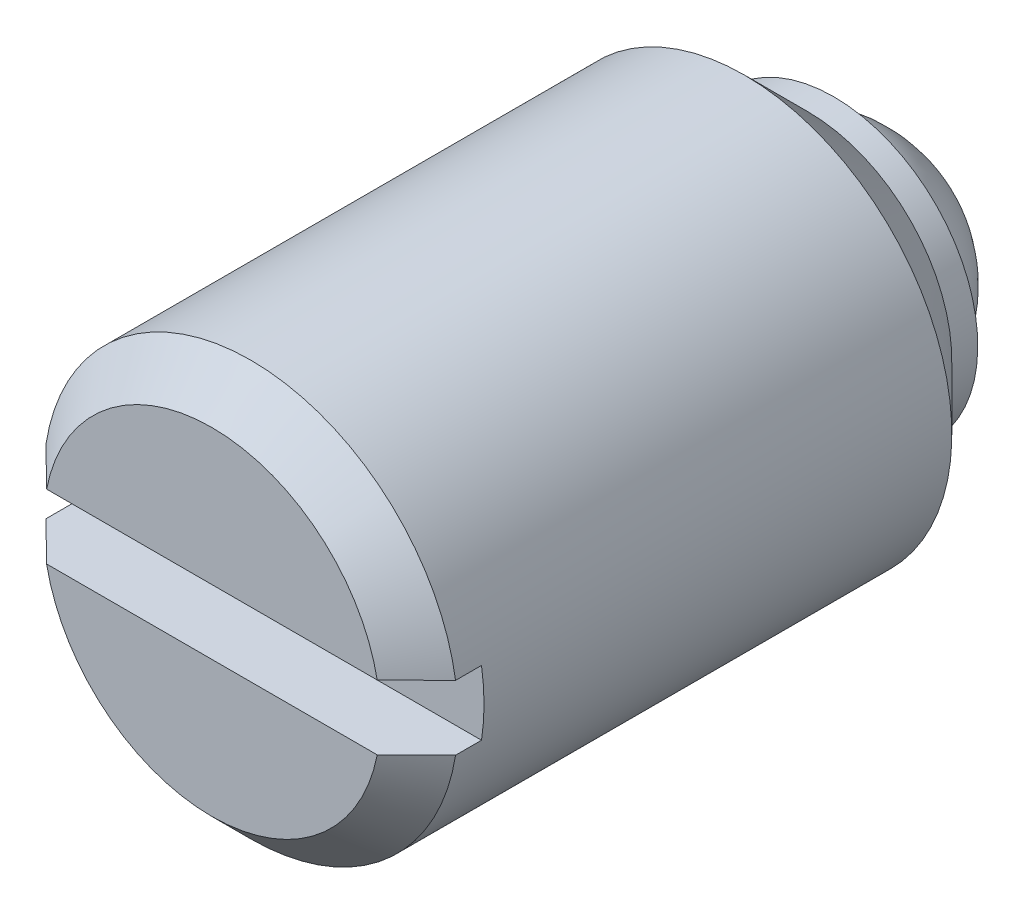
ISO-10303-21;
HEADER;
FILE_DESCRIPTION(('STEP AP214'),'2;1');
FILE_NAME('part.step','',(''),(''),'','','');
FILE_SCHEMA(('AUTOMOTIVE_DESIGN { 1 0 10303 214 1 1 1 1 }'));
ENDSEC;
DATA;
#1=APPLICATION_CONTEXT('core data for automotive mechanical design processes');
#2=APPLICATION_PROTOCOL_DEFINITION('international standard','automotive_design',2000,#1);
#3=PRODUCT_CONTEXT('',#1,'mechanical');
#4=PRODUCT('Part','Part','',(#3));
#5=PRODUCT_RELATED_PRODUCT_CATEGORY('part','',(#4));
#6=PRODUCT_DEFINITION_FORMATION('','',#4);
#7=PRODUCT_DEFINITION_CONTEXT('part definition',#1,'design');
#8=PRODUCT_DEFINITION('design','',#6,#7);
#9=PRODUCT_DEFINITION_SHAPE('','',#8);
#10=(LENGTH_UNIT() NAMED_UNIT(*) SI_UNIT(.MILLI.,.METRE.));
#11=(NAMED_UNIT(*) PLANE_ANGLE_UNIT() SI_UNIT($,.RADIAN.));
#12=(NAMED_UNIT(*) SI_UNIT($,.STERADIAN.) SOLID_ANGLE_UNIT());
#13=UNCERTAINTY_MEASURE_WITH_UNIT(LENGTH_MEASURE(1.E-05),#10,'distance_accuracy_value','');
#14=(GEOMETRIC_REPRESENTATION_CONTEXT(3) GLOBAL_UNCERTAINTY_ASSIGNED_CONTEXT((#13)) GLOBAL_UNIT_ASSIGNED_CONTEXT((#10,
#11,#12)) REPRESENTATION_CONTEXT('',''));
#15=CARTESIAN_POINT('',(0.,0.,0.));
#16=DIRECTION('',(0.,0.,1.));
#17=DIRECTION('',(1.,0.,0.));
#18=AXIS2_PLACEMENT_3D('',#15,#16,#17);
#19=CARTESIAN_POINT('',(0.,8.,27.5));
#20=DIRECTION('',(0.,0.,1.));
#21=DIRECTION('',(1.,0.,0.));
#22=AXIS2_PLACEMENT_3D('',#19,#20,#21);
#23=PLANE('',#22);
#24=CARTESIAN_POINT('',(0.,0.,27.5));
#25=DIRECTION('',(0.,0.,-1.));
#26=DIRECTION('',(0.,1.,0.));
#27=AXIS2_PLACEMENT_3D('',#24,#25,#26);
#28=CIRCLE('',#27,6.5);
#29=CARTESIAN_POINT('',(-6.37867541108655,1.25,27.5));
#30=VERTEX_POINT('',#29);
#31=CARTESIAN_POINT('',(6.37867541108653,1.25,27.5));
#32=VERTEX_POINT('',#31);
#33=EDGE_CURVE('E35',#30,#32,#28,.T.);
#34=ORIENTED_EDGE('',*,*,#33,.F.);
#35=DIRECTION('',(1.,0.,0.));
#36=VECTOR('',#35,1.);
#37=CARTESIAN_POINT('',(-7.90174031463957,1.25,27.5));
#38=LINE('',#37,#36);
#39=EDGE_CURVE('E124',#30,#32,#38,.T.);
#40=ORIENTED_EDGE('',*,*,#39,.T.);
#41=EDGE_LOOP('',(#34,#40));
#42=FACE_BOUND('',#41,.T.);
#43=ADVANCED_FACE('F14',(#42),#23,.T.);
#44=CARTESIAN_POINT('',(0.,0.,-2.5));
#45=DIRECTION('',(0.,0.,-1.));
#46=DIRECTION('',(-1.,0.,0.));
#47=AXIS2_PLACEMENT_3D('',#44,#45,#46);
#48=CYLINDRICAL_SURFACE('',#47,8.);
#49=CARTESIAN_POINT('',(0.,0.,26.));
#50=DIRECTION('',(0.,0.,-1.));
#51=DIRECTION('',(0.,1.,0.));
#52=AXIS2_PLACEMENT_3D('',#49,#50,#51);
#53=CIRCLE('',#52,8.);
#54=CARTESIAN_POINT('',(7.90174031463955,-1.25,26.));
#55=VERTEX_POINT('',#54);
#56=CARTESIAN_POINT('',(-7.90174031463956,-1.25,26.));
#57=VERTEX_POINT('',#56);
#58=EDGE_CURVE('E43',#55,#57,#53,.T.);
#59=ORIENTED_EDGE('',*,*,#58,.T.);
#60=DIRECTION('',(0.,0.,1.));
#61=VECTOR('',#60,1.);
#62=CARTESIAN_POINT('',(-7.90174031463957,-1.25,25.));
#63=LINE('',#62,#61);
#64=CARTESIAN_POINT('',(-7.90174031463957,-1.25,25.));
#65=VERTEX_POINT('',#64);
#66=EDGE_CURVE('E101',#65,#57,#63,.T.);
#67=ORIENTED_EDGE('',*,*,#66,.F.);
#68=CARTESIAN_POINT('',(0.,0.,25.));
#69=DIRECTION('',(0.,0.,1.));
#70=DIRECTION('',(1.,0.,0.));
#71=AXIS2_PLACEMENT_3D('',#68,#69,#70);
#72=CIRCLE('',#71,8.);
#73=CARTESIAN_POINT('',(-7.90174031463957,1.25,25.));
#74=VERTEX_POINT('',#73);
#75=EDGE_CURVE('E121',#74,#65,#72,.T.);
#76=ORIENTED_EDGE('',*,*,#75,.F.);
#77=DIRECTION('',(0.,0.,1.));
#78=VECTOR('',#77,1.);
#79=CARTESIAN_POINT('',(-7.90174031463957,1.25,25.));
#80=LINE('',#79,#78);
#81=CARTESIAN_POINT('',(-7.90174031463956,1.25,26.));
#82=VERTEX_POINT('',#81);
#83=EDGE_CURVE('E89',#74,#82,#80,.T.);
#84=ORIENTED_EDGE('',*,*,#83,.T.);
#85=CARTESIAN_POINT('',(7.90174031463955,1.25,26.));
#86=VERTEX_POINT('',#85);
#87=EDGE_CURVE('E73',#82,#86,#53,.T.);
#88=ORIENTED_EDGE('',*,*,#87,.T.);
#89=DIRECTION('',(0.,0.,1.));
#90=VECTOR('',#89,1.);
#91=CARTESIAN_POINT('',(7.90174031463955,1.25,25.));
#92=LINE('',#91,#90);
#93=CARTESIAN_POINT('',(7.90174031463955,1.25,25.));
#94=VERTEX_POINT('',#93);
#95=EDGE_CURVE('E87',#94,#86,#92,.T.);
#96=ORIENTED_EDGE('',*,*,#95,.F.);
#97=CARTESIAN_POINT('',(7.90174031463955,-1.25,25.));
#98=VERTEX_POINT('',#97);
#99=EDGE_CURVE('E117',#98,#94,#72,.T.);
#100=ORIENTED_EDGE('',*,*,#99,.F.);
#101=DIRECTION('',(0.,0.,1.));
#102=VECTOR('',#101,1.);
#103=CARTESIAN_POINT('',(7.90174031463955,-1.25,25.));
#104=LINE('',#103,#102);
#105=EDGE_CURVE('E96',#98,#55,#104,.T.);
#106=ORIENTED_EDGE('',*,*,#105,.T.);
#107=EDGE_LOOP('',(#59,#67,#76,#84,#88,#96,#100,#106));
#108=FACE_BOUND('',#107,.T.);
#109=CARTESIAN_POINT('',(0.,0.,6.95));
#110=DIRECTION('',(0.,0.,-1.));
#111=DIRECTION('',(0.,1.,0.));
#112=AXIS2_PLACEMENT_3D('',#109,#110,#111);
#113=CIRCLE('',#112,8.);
#114=CARTESIAN_POINT('',(0.,8.,6.95));
#115=VERTEX_POINT('',#114);
#116=EDGE_CURVE('E135',#115,#115,#113,.T.);
#117=ORIENTED_EDGE('',*,*,#116,.F.);
#118=EDGE_LOOP('',(#117));
#119=FACE_BOUND('',#118,.T.);
#120=ADVANCED_FACE('F84',(#108,#119),#48,.T.);
#121=CARTESIAN_POINT('',(6.37867541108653,-1.25,27.5));
#122=VERTEX_POINT('',#121);
#123=CARTESIAN_POINT('',(-6.37867541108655,-1.25,27.5));
#124=VERTEX_POINT('',#123);
#125=EDGE_CURVE('E90',#122,#124,#28,.T.);
#126=ORIENTED_EDGE('',*,*,#125,.F.);
#127=DIRECTION('',(1.,0.,0.));
#128=VECTOR('',#127,1.);
#129=CARTESIAN_POINT('',(-7.90174031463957,-1.25,27.5));
#130=LINE('',#129,#128);
#131=EDGE_CURVE('E114',#124,#122,#130,.T.);
#132=ORIENTED_EDGE('',*,*,#131,.F.);
#133=EDGE_LOOP('',(#126,#132));
#134=FACE_BOUND('',#133,.T.);
#135=ADVANCED_FACE('F167',(#134),#23,.T.);
#136=CARTESIAN_POINT('',(-7.90174031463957,1.25,25.));
#137=DIRECTION('',(0.,-1.,0.));
#138=DIRECTION('',(1.,0.,0.));
#139=AXIS2_PLACEMENT_3D('',#136,#137,#138);
#140=PLANE('',#139);
#141=CARTESIAN_POINT('',(-17.4266450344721,1.25,16.5285817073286));
#142=CARTESIAN_POINT('',(-16.8210866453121,1.25,17.1325756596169));
#143=CARTESIAN_POINT('',(-16.2154595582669,1.25,17.7365007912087));
#144=CARTESIAN_POINT('',(-15.003960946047,1.25,18.9441407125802));
#145=CARTESIAN_POINT('',(-14.3980894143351,1.25,19.5478554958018));
#146=CARTESIAN_POINT('',(-13.1856250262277,1.25,20.7553702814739));
#147=CARTESIAN_POINT('',(-12.579031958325,1.25,21.3591700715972));
#148=CARTESIAN_POINT('',(-11.3653769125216,1.25,22.5662641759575));
#149=CARTESIAN_POINT('',(-10.7583149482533,1.25,23.1695585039));
#150=CARTESIAN_POINT('',(-9.54726902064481,1.25,24.3715377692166));
#151=CARTESIAN_POINT('',(-8.94328997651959,1.25,24.9702276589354));
#152=CARTESIAN_POINT('',(-8.03625207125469,1.25,25.8672336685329));
#153=CARTESIAN_POINT('',(-7.73371478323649,1.25,26.166077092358));
#154=CARTESIAN_POINT('',(-7.12814656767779,1.25,26.7632585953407));
#155=CARTESIAN_POINT('',(-6.82511564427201,1.25,27.0615966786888));
#156=CARTESIAN_POINT('',(-6.21845497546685,1.25,27.6574118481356));
#157=CARTESIAN_POINT('',(-5.91482553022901,1.25,27.9548892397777));
#158=CARTESIAN_POINT('',(-5.30644856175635,1.25,28.5487203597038));
#159=CARTESIAN_POINT('',(-5.00170100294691,1.25,28.8450740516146));
#160=CARTESIAN_POINT('',(-4.54320232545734,1.25,29.2881348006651));
#161=CARTESIAN_POINT('',(-4.39015120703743,1.25,29.4355659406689));
#162=CARTESIAN_POINT('',(-4.08341555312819,1.25,29.7297674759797));
#163=CARTESIAN_POINT('',(-3.92973101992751,1.25,29.87653787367));
#164=CARTESIAN_POINT('',(-3.62149706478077,1.25,30.1691522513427));
#165=CARTESIAN_POINT('',(-3.46694768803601,1.25,30.3149962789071));
#166=CARTESIAN_POINT('',(-3.15660483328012,1.25,30.6053534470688));
#167=CARTESIAN_POINT('',(-3.00081138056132,1.25,30.7498666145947));
#168=CARTESIAN_POINT('',(-2.80126227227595,1.25,30.9325450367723));
#169=CARTESIAN_POINT('',(-2.75837814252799,1.25,30.9716624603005));
#170=CARTESIAN_POINT('',(-2.67244812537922,1.25,31.0497194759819));
#171=CARTESIAN_POINT('',(-2.62940223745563,1.25,31.0886590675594));
#172=CARTESIAN_POINT('',(-2.4999878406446,1.25,31.2051788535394));
#173=CARTESIAN_POINT('',(-2.41334630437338,1.25,31.2824566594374));
#174=CARTESIAN_POINT('',(-2.23891853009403,1.25,31.4361071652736));
#175=CARTESIAN_POINT('',(-2.15113016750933,1.25,31.5124774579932));
#176=CARTESIAN_POINT('',(-1.97428550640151,1.25,31.6637217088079));
#177=CARTESIAN_POINT('',(-1.88522935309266,1.25,31.7385958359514));
#178=CARTESIAN_POINT('',(-1.71594078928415,1.25,31.8775257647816));
#179=CARTESIAN_POINT('',(-1.63590307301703,1.25,31.9418178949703));
#180=CARTESIAN_POINT('',(-1.47397804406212,1.25,32.0680241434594));
#181=CARTESIAN_POINT('',(-1.39209099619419,1.25,32.1299385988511));
#182=CARTESIAN_POINT('',(-1.22584168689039,1.25,32.2501758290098));
#183=CARTESIAN_POINT('',(-1.14148238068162,1.25,32.3085026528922));
#184=CARTESIAN_POINT('',(-0.969232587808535,1.25,32.4196297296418));
#185=CARTESIAN_POINT('',(-0.881345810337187,1.25,32.4724355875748));
#186=CARTESIAN_POINT('',(-0.711862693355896,1.25,32.5630701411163));
#187=CARTESIAN_POINT('',(-0.630836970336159,1.25,32.6019439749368));
#188=CARTESIAN_POINT('',(-0.464343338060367,1.25,32.6686935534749));
#189=CARTESIAN_POINT('',(-0.378888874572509,1.25,32.6966006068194));
#190=CARTESIAN_POINT('',(-0.255708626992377,1.25,32.7245951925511));
#191=CARTESIAN_POINT('',(-0.21948944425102,1.25,32.7313894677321));
#192=CARTESIAN_POINT('',(-0.146619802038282,1.25,32.7419455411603));
#193=CARTESIAN_POINT('',(-0.109969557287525,1.25,32.745708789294));
#194=CARTESIAN_POINT('',(-0.0365066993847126,1.25,32.7500038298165));
#195=CARTESIAN_POINT('',(0.000305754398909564,1.25,32.7505382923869));
#196=CARTESIAN_POINT('',(0.0738274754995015,1.25,32.7483628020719));
#197=CARTESIAN_POINT('',(0.11053673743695,1.25,32.7456526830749));
#198=CARTESIAN_POINT('',(0.219755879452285,1.25,32.7328728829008));
#199=CARTESIAN_POINT('',(0.291761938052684,1.25,32.7181751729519));
#200=CARTESIAN_POINT('',(0.397613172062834,1.25,32.6887313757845));
#201=CARTESIAN_POINT('',(0.432580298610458,1.25,32.6776651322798));
#202=CARTESIAN_POINT('',(0.501783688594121,1.25,32.6534332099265));
#203=CARTESIAN_POINT('',(0.536020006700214,1.25,32.6402676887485));
#204=CARTESIAN_POINT('',(0.621590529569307,1.25,32.6047741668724));
#205=CARTESIAN_POINT('',(0.672434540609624,1.25,32.5812720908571));
#206=CARTESIAN_POINT('',(0.772578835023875,1.25,32.5311573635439));
#207=CARTESIAN_POINT('',(0.821878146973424,1.25,32.5045428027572));
#208=CARTESIAN_POINT('',(0.919228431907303,1.25,32.4489096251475));
#209=CARTESIAN_POINT('',(0.967276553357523,1.25,32.4198860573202));
#210=CARTESIAN_POINT('',(1.0622382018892,1.25,32.3600316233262));
#211=CARTESIAN_POINT('',(1.1091514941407,1.25,32.3292003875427));
#212=CARTESIAN_POINT('',(1.2493247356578,1.25,32.2340615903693));
#213=CARTESIAN_POINT('',(1.3411415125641,1.25,32.1676302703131));
#214=CARTESIAN_POINT('',(1.47679782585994,1.25,32.0654276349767));
#215=CARTESIAN_POINT('',(1.52164228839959,1.25,32.0309582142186));
#216=CARTESIAN_POINT('',(1.61076861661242,1.25,31.9612995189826));
#217=CARTESIAN_POINT('',(1.65505050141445,1.25,31.9261102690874));
#218=CARTESIAN_POINT('',(1.80095023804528,1.25,31.8085941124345));
#219=CARTESIAN_POINT('',(1.9015520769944,1.25,31.7250080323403));
#220=CARTESIAN_POINT('',(2.10103789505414,1.25,31.5558049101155));
#221=CARTESIAN_POINT('',(2.19992169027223,1.25,31.4701876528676));
#222=CARTESIAN_POINT('',(2.39647869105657,1.25,31.297518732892));
#223=CARTESIAN_POINT('',(2.49415152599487,1.25,31.2104666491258));
#224=CARTESIAN_POINT('',(2.6885800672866,1.25,31.035342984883));
#225=CARTESIAN_POINT('',(2.7853357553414,1.25,30.9472713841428));
#226=CARTESIAN_POINT('',(3.07482814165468,1.25,30.6817019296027));
#227=CARTESIAN_POINT('',(3.26653180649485,1.25,30.503079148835));
#228=CARTESIAN_POINT('',(3.64823435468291,1.25,30.1440988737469));
#229=CARTESIAN_POINT('',(3.83823354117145,1.25,29.9637417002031));
#230=CARTESIAN_POINT('',(4.21574729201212,1.25,29.6031920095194));
#231=CARTESIAN_POINT('',(4.40326987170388,1.25,29.4230078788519));
#232=CARTESIAN_POINT('',(4.77757245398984,1.25,29.0618533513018));
#233=CARTESIAN_POINT('',(4.96435242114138,1.25,28.880882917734));
#234=CARTESIAN_POINT('',(5.33724380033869,1.25,28.5185093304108));
#235=CARTESIAN_POINT('',(5.52335558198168,1.25,28.3371065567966));
#236=CARTESIAN_POINT('',(5.89517266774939,1.25,27.9738906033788));
#237=CARTESIAN_POINT('',(6.08087797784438,1.25,27.792077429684));
#238=CARTESIAN_POINT('',(6.73183263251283,1.25,27.1537117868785));
#239=CARTESIAN_POINT('',(7.19628647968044,1.25,26.6963483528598));
#240=CARTESIAN_POINT('',(8.12416030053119,1.25,25.7805691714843));
#241=CARTESIAN_POINT('',(8.5875802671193,1.25,25.3221534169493));
#242=CARTESIAN_POINT('',(9.51390860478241,1.25,24.4045354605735));
#243=CARTESIAN_POINT('',(9.97681678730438,1.25,23.945333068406));
#244=CARTESIAN_POINT('',(10.9022083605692,1.25,23.0265026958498));
#245=CARTESIAN_POINT('',(11.3646917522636,1.25,22.566874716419));
#246=CARTESIAN_POINT('',(12.2941479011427,1.25,21.6425663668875));
#247=CARTESIAN_POINT('',(12.7611176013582,1.25,21.1778829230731));
#248=CARTESIAN_POINT('',(13.6948418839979,1.25,20.2482992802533));
#249=CARTESIAN_POINT('',(14.1615964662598,1.25,19.7833990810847));
#250=CARTESIAN_POINT('',(15.0948026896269,1.25,18.853581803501));
#251=CARTESIAN_POINT('',(15.5612543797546,1.25,18.3886647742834));
#252=CARTESIAN_POINT('',(16.4940337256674,1.25,17.4587070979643));
#253=CARTESIAN_POINT('',(16.960361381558,1.25,16.9936664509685));
#254=CARTESIAN_POINT('',(17.4266450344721,1.25,16.5285817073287));
#255=B_SPLINE_CURVE_WITH_KNOTS('',3,(#141,#142,#143,#144,#145,#146,#147,#148,#149,#150,#151,
#152,#153,#154,#155,#156,#157,#158,#159,#160,#161,#162,#163,#164,#165,#166,#167,#168,#169,#170,
#171,#172,#173,#174,#175,#176,#177,#178,#179,#180,#181,#182,#183,#184,#185,#186,#187,#188,#189,
#190,#191,#192,#193,#194,#195,#196,#197,#198,#199,#200,#201,#202,#203,#204,#205,#206,#207,#208,
#209,#210,#211,#212,#213,#214,#215,#216,#217,#218,#219,#220,#221,#222,#223,#224,#225,#226,#227,
#228,#229,#230,#231,#232,#233,#234,#235,#236,#237,#238,#239,#240,#241,#242,#243,#244,#245,#246,
#247,#248,#249,#250,#251,#252,#253,#254),.UNSPECIFIED.,.F.,.F.,(4,2,2,2,2,2,2,2,2,2,2,2,2,2,2,2,
2,2,2,2,2,2,2,2,2,2,2,2,2,2,2,2,2,2,2,2,2,2,2,2,2,2,2,2,2,2,2,2,2,2,2,2,2,2,2,2,4),(0.,
2.56585018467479,5.13177426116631,7.69941188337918,10.2669774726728,12.8182466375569,
14.0939914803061,15.3697256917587,16.644931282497,17.9201778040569,18.5577070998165,
19.1952340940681,19.8327280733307,20.4702091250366,20.6443436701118,20.8184787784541,
21.1667640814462,21.5158273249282,21.8648509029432,22.1728079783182,22.4807212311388,
22.7882803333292,23.0955240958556,23.3646838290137,23.6330694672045,23.7435137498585,
23.853905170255,23.9642052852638,24.0745110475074,24.2939227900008,24.4039083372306,
24.5138856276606,24.681776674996,24.8497712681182,25.0181201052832,25.1865034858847,
25.5263240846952,25.6960060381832,25.8656822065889,26.2580209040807,26.6504013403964,
27.0428990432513,27.4354045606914,28.2214526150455,29.0073579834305,29.7875334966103,
30.5677458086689,31.3474250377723,32.1270927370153,34.0826164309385,36.0381535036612,
37.9942607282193,39.9503635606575,41.9267041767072,43.9030462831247,45.8787803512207,
47.8545127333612),.UNSPECIFIED.);
#256=EDGE_CURVE('E79',#82,#30,#255,.T.);
#257=ORIENTED_EDGE('',*,*,#256,.F.);
#258=ORIENTED_EDGE('',*,*,#83,.F.);
#259=DIRECTION('',(1.,0.,0.));
#260=VECTOR('',#259,1.);
#261=CARTESIAN_POINT('',(-7.90174031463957,1.25,25.));
#262=LINE('',#261,#260);
#263=EDGE_CURVE('E95',#74,#94,#262,.T.);
#264=ORIENTED_EDGE('',*,*,#263,.T.);
#265=ORIENTED_EDGE('',*,*,#95,.T.);
#266=EDGE_CURVE('E70',#32,#86,#255,.T.);
#267=ORIENTED_EDGE('',*,*,#266,.F.);
#268=ORIENTED_EDGE('',*,*,#39,.F.);
#269=EDGE_LOOP('',(#257,#258,#264,#265,#267,#268));
#270=FACE_BOUND('',#269,.T.);
#271=ADVANCED_FACE('F93',(#270),#140,.T.);
#272=CARTESIAN_POINT('',(-7.90174031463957,-1.25,25.));
#273=DIRECTION('',(0.,-1.,0.));
#274=DIRECTION('',(1.,0.,0.));
#275=AXIS2_PLACEMENT_3D('',#272,#273,#274);
#276=PLANE('',#275);
#277=ORIENTED_EDGE('',*,*,#66,.T.);
#278=CARTESIAN_POINT('',(-17.4266450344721,-1.25,16.5285817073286));
#279=CARTESIAN_POINT('',(-16.8210866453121,-1.25,17.1325756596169));
#280=CARTESIAN_POINT('',(-16.2154595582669,-1.25,17.7365007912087));
#281=CARTESIAN_POINT('',(-15.0039609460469,-1.25,18.9441407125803));
#282=CARTESIAN_POINT('',(-14.398089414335,-1.25,19.5478554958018));
#283=CARTESIAN_POINT('',(-13.1856250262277,-1.25,20.755370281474));
#284=CARTESIAN_POINT('',(-12.5790319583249,-1.25,21.3591700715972));
#285=CARTESIAN_POINT('',(-11.3653769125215,-1.25,22.5662641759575));
#286=CARTESIAN_POINT('',(-10.7583149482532,-1.25,23.1695585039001));
#287=CARTESIAN_POINT('',(-9.54726902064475,-1.25,24.3715377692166));
#288=CARTESIAN_POINT('',(-8.94328997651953,-1.25,24.9702276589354));
#289=CARTESIAN_POINT('',(-8.03625207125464,-1.25,25.867233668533));
#290=CARTESIAN_POINT('',(-7.73371478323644,-1.25,26.166077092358));
#291=CARTESIAN_POINT('',(-7.12814656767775,-1.25,26.7632585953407));
#292=CARTESIAN_POINT('',(-6.82511564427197,-1.25,27.0615966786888));
#293=CARTESIAN_POINT('',(-6.21845497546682,-1.25,27.6574118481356));
#294=CARTESIAN_POINT('',(-5.91482553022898,-1.25,27.9548892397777));
#295=CARTESIAN_POINT('',(-5.30644856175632,-1.25,28.5487203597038));
#296=CARTESIAN_POINT('',(-5.00170100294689,-1.25,28.8450740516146));
#297=CARTESIAN_POINT('',(-4.54320232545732,-1.25,29.2881348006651));
#298=CARTESIAN_POINT('',(-4.39015120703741,-1.25,29.435565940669));
#299=CARTESIAN_POINT('',(-4.08341555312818,-1.25,29.7297674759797));
#300=CARTESIAN_POINT('',(-3.9297310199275,-1.25,29.87653787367));
#301=CARTESIAN_POINT('',(-3.62149706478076,-1.25,30.1691522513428));
#302=CARTESIAN_POINT('',(-3.46694768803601,-1.25,30.3149962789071));
#303=CARTESIAN_POINT('',(-3.15660483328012,-1.25,30.6053534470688));
#304=CARTESIAN_POINT('',(-3.00081138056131,-1.25,30.7498666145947));
#305=CARTESIAN_POINT('',(-2.80126227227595,-1.25,30.9325450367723));
#306=CARTESIAN_POINT('',(-2.75837814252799,-1.25,30.9716624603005));
#307=CARTESIAN_POINT('',(-2.67244812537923,-1.25,31.0497194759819));
#308=CARTESIAN_POINT('',(-2.62940223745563,-1.25,31.0886590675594));
#309=CARTESIAN_POINT('',(-2.4999878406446,-1.25,31.2051788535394));
#310=CARTESIAN_POINT('',(-2.41334630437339,-1.25,31.2824566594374));
#311=CARTESIAN_POINT('',(-2.23891853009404,-1.25,31.4361071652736));
#312=CARTESIAN_POINT('',(-2.15113016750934,-1.25,31.5124774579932));
#313=CARTESIAN_POINT('',(-1.97428550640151,-1.25,31.6637217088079));
#314=CARTESIAN_POINT('',(-1.88522935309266,-1.25,31.7385958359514));
#315=CARTESIAN_POINT('',(-1.71594078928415,-1.25,31.8775257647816));
#316=CARTESIAN_POINT('',(-1.63590307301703,-1.25,31.9418178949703));
#317=CARTESIAN_POINT('',(-1.47397804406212,-1.25,32.0680241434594));
#318=CARTESIAN_POINT('',(-1.39209099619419,-1.25,32.1299385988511));
#319=CARTESIAN_POINT('',(-1.22584168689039,-1.25,32.2501758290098));
#320=CARTESIAN_POINT('',(-1.14148238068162,-1.25,32.3085026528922));
#321=CARTESIAN_POINT('',(-0.969232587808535,-1.25,32.4196297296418));
#322=CARTESIAN_POINT('',(-0.881345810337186,-1.25,32.4724355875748));
#323=CARTESIAN_POINT('',(-0.711862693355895,-1.25,32.5630701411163));
#324=CARTESIAN_POINT('',(-0.63083697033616,-1.25,32.6019439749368));
#325=CARTESIAN_POINT('',(-0.464343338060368,-1.25,32.6686935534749));
#326=CARTESIAN_POINT('',(-0.378888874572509,-1.25,32.6966006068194));
#327=CARTESIAN_POINT('',(-0.255708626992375,-1.25,32.7245951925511));
#328=CARTESIAN_POINT('',(-0.219489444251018,-1.25,32.7313894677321));
#329=CARTESIAN_POINT('',(-0.14661980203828,-1.25,32.7419455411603));
#330=CARTESIAN_POINT('',(-0.109969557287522,-1.25,32.745708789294));
#331=CARTESIAN_POINT('',(-0.0365066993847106,-1.25,32.7500038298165));
#332=CARTESIAN_POINT('',(0.000305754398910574,-1.25,32.7505382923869));
#333=CARTESIAN_POINT('',(0.0738274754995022,-1.25,32.7483628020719));
#334=CARTESIAN_POINT('',(0.110536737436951,-1.25,32.7456526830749));
#335=CARTESIAN_POINT('',(0.219755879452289,-1.25,32.7328728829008));
#336=CARTESIAN_POINT('',(0.291761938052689,-1.25,32.7181751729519));
#337=CARTESIAN_POINT('',(0.397613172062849,-1.25,32.6887313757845));
#338=CARTESIAN_POINT('',(0.432580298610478,-1.25,32.6776651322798));
#339=CARTESIAN_POINT('',(0.501783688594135,-1.25,32.6534332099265));
#340=CARTESIAN_POINT('',(0.536020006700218,-1.25,32.6402676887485));
#341=CARTESIAN_POINT('',(0.621590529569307,-1.25,32.6047741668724));
#342=CARTESIAN_POINT('',(0.672434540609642,-1.25,32.581272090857));
#343=CARTESIAN_POINT('',(0.772578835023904,-1.25,32.5311573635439));
#344=CARTESIAN_POINT('',(0.821878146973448,-1.25,32.5045428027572));
#345=CARTESIAN_POINT('',(0.91922843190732,-1.25,32.4489096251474));
#346=CARTESIAN_POINT('',(0.967276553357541,-1.25,32.4198860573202));
#347=CARTESIAN_POINT('',(1.06223820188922,-1.25,32.3600316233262));
#348=CARTESIAN_POINT('',(1.10915149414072,-1.25,32.3292003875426));
#349=CARTESIAN_POINT('',(1.24932473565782,-1.25,32.2340615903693));
#350=CARTESIAN_POINT('',(1.34114151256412,-1.25,32.1676302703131));
#351=CARTESIAN_POINT('',(1.47679782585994,-1.25,32.0654276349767));
#352=CARTESIAN_POINT('',(1.5216422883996,-1.25,32.0309582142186));
#353=CARTESIAN_POINT('',(1.61076861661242,-1.25,31.9612995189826));
#354=CARTESIAN_POINT('',(1.65505050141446,-1.25,31.9261102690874));
#355=CARTESIAN_POINT('',(1.80095023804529,-1.25,31.8085941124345));
#356=CARTESIAN_POINT('',(1.9015520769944,-1.25,31.7250080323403));
#357=CARTESIAN_POINT('',(2.10103789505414,-1.25,31.5558049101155));
#358=CARTESIAN_POINT('',(2.19992169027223,-1.25,31.4701876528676));
#359=CARTESIAN_POINT('',(2.39647869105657,-1.25,31.297518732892));
#360=CARTESIAN_POINT('',(2.49415152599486,-1.25,31.2104666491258));
#361=CARTESIAN_POINT('',(2.6885800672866,-1.25,31.035342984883));
#362=CARTESIAN_POINT('',(2.7853357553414,-1.25,30.9472713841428));
#363=CARTESIAN_POINT('',(3.07482814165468,-1.25,30.6817019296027));
#364=CARTESIAN_POINT('',(3.26653180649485,-1.25,30.503079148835));
#365=CARTESIAN_POINT('',(3.6482343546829,-1.25,30.1440988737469));
#366=CARTESIAN_POINT('',(3.83823354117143,-1.25,29.9637417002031));
#367=CARTESIAN_POINT('',(4.2157472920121,-1.25,29.6031920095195));
#368=CARTESIAN_POINT('',(4.40326987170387,-1.25,29.4230078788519));
#369=CARTESIAN_POINT('',(4.77757245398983,-1.25,29.0618533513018));
#370=CARTESIAN_POINT('',(4.96435242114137,-1.25,28.880882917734));
#371=CARTESIAN_POINT('',(5.33724380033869,-1.25,28.5185093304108));
#372=CARTESIAN_POINT('',(5.52335558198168,-1.25,28.3371065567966));
#373=CARTESIAN_POINT('',(5.8951726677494,-1.25,27.9738906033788));
#374=CARTESIAN_POINT('',(6.0808779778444,-1.25,27.792077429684));
#375=CARTESIAN_POINT('',(6.73183263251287,-1.25,27.1537117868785));
#376=CARTESIAN_POINT('',(7.19628647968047,-1.25,26.6963483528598));
#377=CARTESIAN_POINT('',(8.12416030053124,-1.25,25.7805691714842));
#378=CARTESIAN_POINT('',(8.58758026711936,-1.25,25.3221534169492));
#379=CARTESIAN_POINT('',(9.51390860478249,-1.25,24.4045354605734));
#380=CARTESIAN_POINT('',(9.97681678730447,-1.25,23.945333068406));
#381=CARTESIAN_POINT('',(10.9022083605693,-1.25,23.0265026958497));
#382=CARTESIAN_POINT('',(11.3646917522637,-1.25,22.5668747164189));
#383=CARTESIAN_POINT('',(12.2941479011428,-1.25,21.6425663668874));
#384=CARTESIAN_POINT('',(12.7611176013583,-1.25,21.177882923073));
#385=CARTESIAN_POINT('',(13.694841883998,-1.25,20.2482992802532));
#386=CARTESIAN_POINT('',(14.1615964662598,-1.25,19.7833990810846));
#387=CARTESIAN_POINT('',(15.094802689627,-1.25,18.8535818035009));
#388=CARTESIAN_POINT('',(15.5612543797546,-1.25,18.3886647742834));
#389=CARTESIAN_POINT('',(16.4940337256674,-1.25,17.4587070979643));
#390=CARTESIAN_POINT('',(16.9603613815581,-1.25,16.9936664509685));
#391=CARTESIAN_POINT('',(17.4266450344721,-1.25,16.5285817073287));
#392=B_SPLINE_CURVE_WITH_KNOTS('',3,(#278,#279,#280,#281,#282,#283,#284,#285,#286,#287,#288,
#289,#290,#291,#292,#293,#294,#295,#296,#297,#298,#299,#300,#301,#302,#303,#304,#305,#306,#307,
#308,#309,#310,#311,#312,#313,#314,#315,#316,#317,#318,#319,#320,#321,#322,#323,#324,#325,#326,
#327,#328,#329,#330,#331,#332,#333,#334,#335,#336,#337,#338,#339,#340,#341,#342,#343,#344,#345,
#346,#347,#348,#349,#350,#351,#352,#353,#354,#355,#356,#357,#358,#359,#360,#361,#362,#363,#364,
#365,#366,#367,#368,#369,#370,#371,#372,#373,#374,#375,#376,#377,#378,#379,#380,#381,#382,#383,
#384,#385,#386,#387,#388,#389,#390,#391),.UNSPECIFIED.,.F.,.F.,(4,2,2,2,2,2,2,2,2,2,2,2,2,2,2,2,
2,2,2,2,2,2,2,2,2,2,2,2,2,2,2,2,2,2,2,2,2,2,2,2,2,2,2,2,2,2,2,2,2,2,2,2,2,2,2,2,4),(0.,
2.56585018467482,5.13177426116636,7.69941188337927,10.2669774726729,12.818246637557,
14.0939914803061,15.3697256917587,16.644931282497,17.9201778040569,18.5577070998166,
19.1952340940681,19.8327280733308,20.4702091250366,20.6443436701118,20.8184787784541,
21.1667640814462,21.5158273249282,21.8648509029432,22.1728079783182,22.4807212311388,
22.7882803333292,23.0955240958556,23.3646838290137,23.6330694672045,23.7435137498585,
23.853905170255,23.9642052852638,24.0745110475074,24.2939227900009,24.4039083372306,
24.5138856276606,24.681776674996,24.8497712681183,25.0181201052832,25.1865034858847,
25.5263240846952,25.6960060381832,25.8656822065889,26.2580209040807,26.6504013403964,
27.0428990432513,27.4354045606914,28.2214526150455,29.0073579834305,29.7875334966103,
30.5677458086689,31.3474250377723,32.1270927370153,34.0826164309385,36.0381535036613,
37.9942607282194,39.9503635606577,41.9267041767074,43.9030462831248,45.8787803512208,
47.8545127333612),.UNSPECIFIED.);
#393=EDGE_CURVE('E9',#57,#124,#392,.T.);
#394=ORIENTED_EDGE('',*,*,#393,.T.);
#395=ORIENTED_EDGE('',*,*,#131,.T.);
#396=EDGE_CURVE('E18',#122,#55,#392,.T.);
#397=ORIENTED_EDGE('',*,*,#396,.T.);
#398=ORIENTED_EDGE('',*,*,#105,.F.);
#399=DIRECTION('',(1.,0.,0.));
#400=VECTOR('',#399,1.);
#401=CARTESIAN_POINT('',(-7.90174031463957,-1.25,25.));
#402=LINE('',#401,#400);
#403=EDGE_CURVE('E119',#65,#98,#402,.T.);
#404=ORIENTED_EDGE('',*,*,#403,.F.);
#405=EDGE_LOOP('',(#277,#394,#395,#397,#398,#404));
#406=FACE_BOUND('',#405,.T.);
#407=ADVANCED_FACE('F111',(#406),#276,.F.);
#408=CARTESIAN_POINT('',(0.,0.,25.));
#409=DIRECTION('',(0.,0.,1.));
#410=DIRECTION('',(1.,0.,0.));
#411=AXIS2_PLACEMENT_3D('',#408,#409,#410);
#412=PLANE('',#411);
#413=ORIENTED_EDGE('',*,*,#75,.T.);
#414=ORIENTED_EDGE('',*,*,#403,.T.);
#415=ORIENTED_EDGE('',*,*,#99,.T.);
#416=ORIENTED_EDGE('',*,*,#263,.F.);
#417=EDGE_LOOP('',(#413,#414,#415,#416));
#418=FACE_BOUND('',#417,.T.);
#419=ADVANCED_FACE('F157',(#418),#412,.T.);
#420=CARTESIAN_POINT('',(0.,0.,-3.99429083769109));
#421=DIRECTION('',(0.,0.,-1.));
#422=DIRECTION('',(0.,1.,0.));
#423=AXIS2_PLACEMENT_3D('',#420,#421,#422);
#424=CYLINDRICAL_SURFACE('',#423,5.55);
#425=CARTESIAN_POINT('',(0.,0.,3.5));
#426=DIRECTION('',(0.,0.,-1.));
#427=DIRECTION('',(0.,1.,0.));
#428=AXIS2_PLACEMENT_3D('',#425,#426,#427);
#429=CIRCLE('',#428,5.55);
#430=CARTESIAN_POINT('',(0.,5.55,3.5));
#431=VERTEX_POINT('',#430);
#432=EDGE_CURVE('E127',#431,#431,#429,.T.);
#433=ORIENTED_EDGE('',*,*,#432,.F.);
#434=EDGE_LOOP('',(#433));
#435=FACE_BOUND('',#434,.T.);
#436=CARTESIAN_POINT('',(0.,0.,4.5));
#437=DIRECTION('',(0.,0.,-1.));
#438=DIRECTION('',(0.,1.,0.));
#439=AXIS2_PLACEMENT_3D('',#436,#437,#438);
#440=CIRCLE('',#439,5.55);
#441=CARTESIAN_POINT('',(0.,5.55,4.5));
#442=VERTEX_POINT('',#441);
#443=EDGE_CURVE('E132',#442,#442,#440,.T.);
#444=ORIENTED_EDGE('',*,*,#443,.T.);
#445=EDGE_LOOP('',(#444));
#446=FACE_BOUND('',#445,.T.);
#447=ADVANCED_FACE('F153',(#435,#446),#424,.T.);
#448=CARTESIAN_POINT('',(0.,0.,6.95));
#449=DIRECTION('',(0.,0.,1.));
#450=DIRECTION('',(0.,-1.,0.));
#451=AXIS2_PLACEMENT_3D('',#448,#449,#450);
#452=CONICAL_SURFACE('',#451,8.,0.785398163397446);
#453=ORIENTED_EDGE('',*,*,#443,.F.);
#454=EDGE_LOOP('',(#453));
#455=FACE_BOUND('',#454,.T.);
#456=ORIENTED_EDGE('',*,*,#116,.T.);
#457=EDGE_LOOP('',(#456));
#458=FACE_BOUND('',#457,.T.);
#459=ADVANCED_FACE('F149',(#455,#458),#452,.T.);
#460=CARTESIAN_POINT('',(0.,0.,5.));
#461=DIRECTION('',(-1.,0.,0.));
#462=DIRECTION('',(0.,0.,1.));
#463=AXIS2_PLACEMENT_3D('',#460,#461,#462);
#464=SPHERICAL_SURFACE('',#463,5.);
#465=CARTESIAN_POINT('',(0.,0.,5.));
#466=DIRECTION('',(0.,0.,-1.));
#467=DIRECTION('',(-1.,0.,0.));
#468=AXIS2_PLACEMENT_3D('',#465,#466,#467);
#469=SPHERICAL_SURFACE('',#468,5.);
#470=CARTESIAN_POINT('',(0.,0.,3.5));
#471=DIRECTION('',(0.,0.,-1.));
#472=DIRECTION('',(-1.,0.,0.));
#473=AXIS2_PLACEMENT_3D('',#470,#471,#472);
#474=CIRCLE('',#473,4.76969600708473);
#475=CARTESIAN_POINT('',(-4.76969600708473,0.,3.5));
#476=VERTEX_POINT('',#475);
#477=EDGE_CURVE('E98',#476,#476,#474,.T.);
#478=ORIENTED_EDGE('',*,*,#477,.T.);
#479=EDGE_LOOP('',(#478));
#480=FACE_BOUND('',#479,.T.);
#481=ADVANCED_FACE('F16',(#480),#469,.T.);
#482=CARTESIAN_POINT('',(0.,4.76969600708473,3.5));
#483=DIRECTION('',(0.,0.,-1.));
#484=DIRECTION('',(-1.,0.,0.));
#485=AXIS2_PLACEMENT_3D('',#482,#483,#484);
#486=PLANE('',#485);
#487=ORIENTED_EDGE('',*,*,#432,.T.);
#488=EDGE_LOOP('',(#487));
#489=FACE_BOUND('',#488,.T.);
#490=ORIENTED_EDGE('',*,*,#477,.F.);
#491=EDGE_LOOP('',(#490));
#492=FACE_BOUND('',#491,.T.);
#493=ADVANCED_FACE('F180',(#489,#492),#486,.T.);
#494=CARTESIAN_POINT('',(0.,0.,27.5));
#495=DIRECTION('',(0.,0.,-1.));
#496=DIRECTION('',(0.,1.,0.));
#497=AXIS2_PLACEMENT_3D('',#494,#495,#496);
#498=CONICAL_SURFACE('',#497,6.5,0.785398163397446);
#499=ORIENTED_EDGE('',*,*,#58,.F.);
#500=ORIENTED_EDGE('',*,*,#396,.F.);
#501=ORIENTED_EDGE('',*,*,#125,.T.);
#502=ORIENTED_EDGE('',*,*,#393,.F.);
#503=EDGE_LOOP('',(#499,#500,#501,#502));
#504=FACE_BOUND('',#503,.T.);
#505=ADVANCED_FACE('F148',(#504),#498,.T.);
#506=ORIENTED_EDGE('',*,*,#256,.T.);
#507=ORIENTED_EDGE('',*,*,#33,.T.);
#508=ORIENTED_EDGE('',*,*,#266,.T.);
#509=ORIENTED_EDGE('',*,*,#87,.F.);
#510=EDGE_LOOP('',(#506,#507,#508,#509));
#511=FACE_BOUND('',#510,.T.);
#512=ADVANCED_FACE('F72',(#511),#498,.T.);
#513=CLOSED_SHELL('',(#43,#120,#135,#271,#407,#419,#447,#459,#481,#493,#505,#512));
#514=MANIFOLD_SOLID_BREP('B1',#513);
#515=ADVANCED_BREP_SHAPE_REPRESENTATION('',(#18,#514),#14);
#516=SHAPE_DEFINITION_REPRESENTATION(#9,#515);
ENDSEC;
END-ISO-10303-21;
